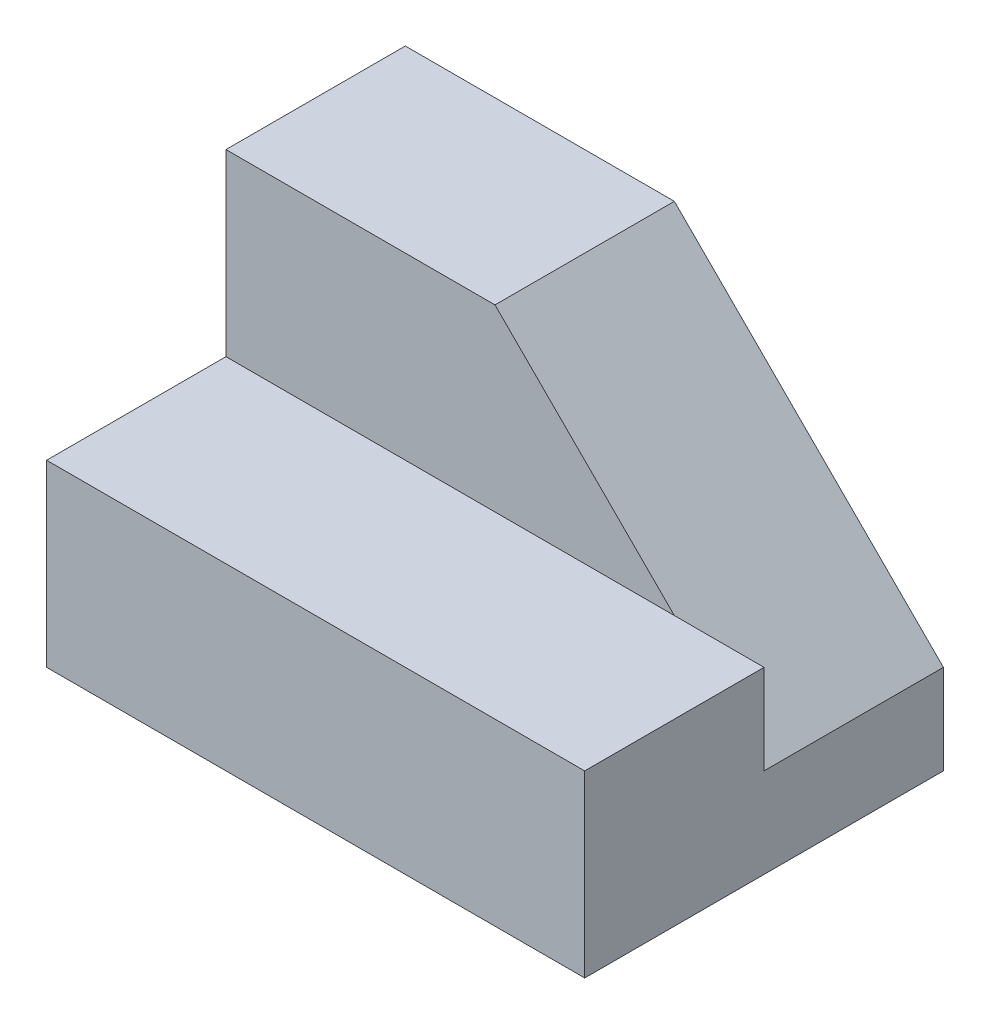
ISO-10303-21;
HEADER;
FILE_DESCRIPTION(('STEP AP214'),'2;1');
FILE_NAME('part.step','',(''),(''),'','','');
FILE_SCHEMA(('AUTOMOTIVE_DESIGN { 1 0 10303 214 1 1 1 1 }'));
ENDSEC;
DATA;
#1=APPLICATION_CONTEXT('core data for automotive mechanical design processes');
#2=APPLICATION_PROTOCOL_DEFINITION('international standard','automotive_design',2000,#1);
#3=PRODUCT_CONTEXT('',#1,'mechanical');
#4=PRODUCT('Part','Part','',(#3));
#5=PRODUCT_RELATED_PRODUCT_CATEGORY('part','',(#4));
#6=PRODUCT_DEFINITION_FORMATION('','',#4);
#7=PRODUCT_DEFINITION_CONTEXT('part definition',#1,'design');
#8=PRODUCT_DEFINITION('design','',#6,#7);
#9=PRODUCT_DEFINITION_SHAPE('','',#8);
#10=(LENGTH_UNIT() NAMED_UNIT(*) SI_UNIT(.MILLI.,.METRE.));
#11=(NAMED_UNIT(*) PLANE_ANGLE_UNIT() SI_UNIT($,.RADIAN.));
#12=(NAMED_UNIT(*) SI_UNIT($,.STERADIAN.) SOLID_ANGLE_UNIT());
#13=UNCERTAINTY_MEASURE_WITH_UNIT(LENGTH_MEASURE(1.E-05),#10,'distance_accuracy_value','');
#14=(GEOMETRIC_REPRESENTATION_CONTEXT(3) GLOBAL_UNCERTAINTY_ASSIGNED_CONTEXT((#13)) GLOBAL_UNIT_ASSIGNED_CONTEXT((#10,
#11,#12)) REPRESENTATION_CONTEXT('',''));
#15=CARTESIAN_POINT('',(0.,0.,0.));
#16=DIRECTION('',(0.,0.,1.));
#17=DIRECTION('',(1.,0.,0.));
#18=AXIS2_PLACEMENT_3D('',#15,#16,#17);
#19=CARTESIAN_POINT('',(-30.,40.,20.));
#20=DIRECTION('',(1.,0.,0.));
#21=DIRECTION('',(0.,0.,-1.));
#22=AXIS2_PLACEMENT_3D('',#19,#20,#21);
#23=PLANE('',#22);
#24=DIRECTION('',(0.,-1.,0.));
#25=VECTOR('',#24,1.);
#26=CARTESIAN_POINT('',(-30.,40.,20.));
#27=LINE('',#26,#25);
#28=CARTESIAN_POINT('',(-30.,20.,20.));
#29=VERTEX_POINT('',#28);
#30=CARTESIAN_POINT('',(-30.,0.,20.));
#31=VERTEX_POINT('',#30);
#32=EDGE_CURVE('E38',#29,#31,#27,.T.);
#33=ORIENTED_EDGE('',*,*,#32,.F.);
#34=DIRECTION('',(0.,0.,1.));
#35=VECTOR('',#34,1.);
#36=CARTESIAN_POINT('',(-30.,20.,0.));
#37=LINE('',#36,#35);
#38=CARTESIAN_POINT('',(-30.,20.,0.));
#39=VERTEX_POINT('',#38);
#40=EDGE_CURVE('E116',#39,#29,#37,.T.);
#41=ORIENTED_EDGE('',*,*,#40,.F.);
#42=DIRECTION('',(0.,-1.,0.));
#43=VECTOR('',#42,1.);
#44=CARTESIAN_POINT('',(-30.,20.,0.));
#45=LINE('',#44,#43);
#46=CARTESIAN_POINT('',(-30.,40.,0.));
#47=VERTEX_POINT('',#46);
#48=EDGE_CURVE('E124',#47,#39,#45,.T.);
#49=ORIENTED_EDGE('',*,*,#48,.F.);
#50=DIRECTION('',(0.,0.,1.));
#51=VECTOR('',#50,1.);
#52=CARTESIAN_POINT('',(-30.,40.,20.));
#53=LINE('',#52,#51);
#54=CARTESIAN_POINT('',(-30.,40.,-20.));
#55=VERTEX_POINT('',#54);
#56=EDGE_CURVE('E98',#55,#47,#53,.T.);
#57=ORIENTED_EDGE('',*,*,#56,.F.);
#58=DIRECTION('',(0.,-1.,0.));
#59=VECTOR('',#58,1.);
#60=CARTESIAN_POINT('',(-30.,40.,-20.));
#61=LINE('',#60,#59);
#62=CARTESIAN_POINT('',(-30.,0.,-20.));
#63=VERTEX_POINT('',#62);
#64=EDGE_CURVE('E82',#55,#63,#61,.T.);
#65=ORIENTED_EDGE('',*,*,#64,.T.);
#66=DIRECTION('',(0.,0.,1.));
#67=VECTOR('',#66,1.);
#68=CARTESIAN_POINT('',(-30.,0.,20.));
#69=LINE('',#68,#67);
#70=EDGE_CURVE('E97',#63,#31,#69,.T.);
#71=ORIENTED_EDGE('',*,*,#70,.T.);
#72=EDGE_LOOP('',(#33,#41,#49,#57,#65,#71));
#73=FACE_BOUND('',#72,.T.);
#74=ADVANCED_FACE('F31',(#73),#23,.F.);
#75=CARTESIAN_POINT('',(-30.,40.,20.));
#76=DIRECTION('',(0.,0.,-1.));
#77=DIRECTION('',(-1.,0.,0.));
#78=AXIS2_PLACEMENT_3D('',#75,#76,#77);
#79=PLANE('',#78);
#80=DIRECTION('',(0.,-1.,0.));
#81=VECTOR('',#80,1.);
#82=CARTESIAN_POINT('',(30.,40.,20.));
#83=LINE('',#82,#81);
#84=CARTESIAN_POINT('',(30.,20.,20.));
#85=VERTEX_POINT('',#84);
#86=CARTESIAN_POINT('',(30.,0.,20.));
#87=VERTEX_POINT('',#86);
#88=EDGE_CURVE('E81',#85,#87,#83,.T.);
#89=ORIENTED_EDGE('',*,*,#88,.F.);
#90=DIRECTION('',(1.,0.,0.));
#91=VECTOR('',#90,1.);
#92=CARTESIAN_POINT('',(-30.,20.,20.));
#93=LINE('',#92,#91);
#94=EDGE_CURVE('E110',#29,#85,#93,.T.);
#95=ORIENTED_EDGE('',*,*,#94,.F.);
#96=ORIENTED_EDGE('',*,*,#32,.T.);
#97=DIRECTION('',(1.,0.,0.));
#98=VECTOR('',#97,1.);
#99=CARTESIAN_POINT('',(-30.,0.,20.));
#100=LINE('',#99,#98);
#101=EDGE_CURVE('E92',#31,#87,#100,.T.);
#102=ORIENTED_EDGE('',*,*,#101,.T.);
#103=EDGE_LOOP('',(#89,#95,#96,#102));
#104=FACE_BOUND('',#103,.T.);
#105=ADVANCED_FACE('F107',(#104),#79,.F.);
#106=CARTESIAN_POINT('',(30.,40.,20.));
#107=DIRECTION('',(-1.,0.,0.));
#108=DIRECTION('',(0.,0.,1.));
#109=AXIS2_PLACEMENT_3D('',#106,#107,#108);
#110=PLANE('',#109);
#111=DIRECTION('',(0.,-1.,0.));
#112=VECTOR('',#111,1.);
#113=CARTESIAN_POINT('',(30.,40.,-20.));
#114=LINE('',#113,#112);
#115=CARTESIAN_POINT('',(30.,10.,-20.));
#116=VERTEX_POINT('',#115);
#117=CARTESIAN_POINT('',(30.,0.,-20.));
#118=VERTEX_POINT('',#117);
#119=EDGE_CURVE('E71',#116,#118,#114,.T.);
#120=ORIENTED_EDGE('',*,*,#119,.F.);
#121=DIRECTION('',(0.,0.,-1.));
#122=VECTOR('',#121,1.);
#123=CARTESIAN_POINT('',(30.,10.,0.));
#124=LINE('',#123,#122);
#125=CARTESIAN_POINT('',(30.,10.,0.));
#126=VERTEX_POINT('',#125);
#127=EDGE_CURVE('E133',#126,#116,#124,.T.);
#128=ORIENTED_EDGE('',*,*,#127,.F.);
#129=DIRECTION('',(0.,-1.,0.));
#130=VECTOR('',#129,1.);
#131=CARTESIAN_POINT('',(30.,10.,0.));
#132=LINE('',#131,#130);
#133=CARTESIAN_POINT('',(30.,20.,0.));
#134=VERTEX_POINT('',#133);
#135=EDGE_CURVE('E139',#134,#126,#132,.T.);
#136=ORIENTED_EDGE('',*,*,#135,.F.);
#137=DIRECTION('',(0.,0.,1.));
#138=VECTOR('',#137,1.);
#139=CARTESIAN_POINT('',(30.,20.,0.));
#140=LINE('',#139,#138);
#141=EDGE_CURVE('E114',#134,#85,#140,.T.);
#142=ORIENTED_EDGE('',*,*,#141,.T.);
#143=ORIENTED_EDGE('',*,*,#88,.T.);
#144=DIRECTION('',(0.,0.,-1.));
#145=VECTOR('',#144,1.);
#146=CARTESIAN_POINT('',(30.,0.,20.));
#147=LINE('',#146,#145);
#148=EDGE_CURVE('E85',#87,#118,#147,.T.);
#149=ORIENTED_EDGE('',*,*,#148,.T.);
#150=EDGE_LOOP('',(#120,#128,#136,#142,#143,#149));
#151=FACE_BOUND('',#150,.T.);
#152=ADVANCED_FACE('F86',(#151),#110,.F.);
#153=CARTESIAN_POINT('',(-30.,40.,-20.));
#154=DIRECTION('',(0.,0.,1.));
#155=DIRECTION('',(1.,0.,0.));
#156=AXIS2_PLACEMENT_3D('',#153,#154,#155);
#157=PLANE('',#156);
#158=DIRECTION('',(-1.,0.,0.));
#159=VECTOR('',#158,1.);
#160=CARTESIAN_POINT('',(-30.,40.,-20.));
#161=LINE('',#160,#159);
#162=CARTESIAN_POINT('',(0.,40.,-20.));
#163=VERTEX_POINT('',#162);
#164=EDGE_CURVE('E52',#163,#55,#161,.T.);
#165=ORIENTED_EDGE('',*,*,#164,.F.);
#166=DIRECTION('',(-0.707106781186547,0.707106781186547,0.));
#167=VECTOR('',#166,1.);
#168=CARTESIAN_POINT('',(0.,40.,-20.));
#169=LINE('',#168,#167);
#170=EDGE_CURVE('E78',#116,#163,#169,.T.);
#171=ORIENTED_EDGE('',*,*,#170,.F.);
#172=ORIENTED_EDGE('',*,*,#119,.T.);
#173=DIRECTION('',(-1.,0.,0.));
#174=VECTOR('',#173,1.);
#175=CARTESIAN_POINT('',(-30.,0.,-20.));
#176=LINE('',#175,#174);
#177=EDGE_CURVE('E75',#118,#63,#176,.T.);
#178=ORIENTED_EDGE('',*,*,#177,.T.);
#179=ORIENTED_EDGE('',*,*,#64,.F.);
#180=EDGE_LOOP('',(#165,#171,#172,#178,#179));
#181=FACE_BOUND('',#180,.T.);
#182=ADVANCED_FACE('F73',(#181),#157,.F.);
#183=CARTESIAN_POINT('',(-30.,40.,-20.));
#184=DIRECTION('',(0.,-1.,0.));
#185=DIRECTION('',(0.,0.,-1.));
#186=AXIS2_PLACEMENT_3D('',#183,#184,#185);
#187=PLANE('',#186);
#188=DIRECTION('',(-1.,0.,0.));
#189=VECTOR('',#188,1.);
#190=CARTESIAN_POINT('',(-30.,40.,0.));
#191=LINE('',#190,#189);
#192=CARTESIAN_POINT('',(0.,40.,0.));
#193=VERTEX_POINT('',#192);
#194=EDGE_CURVE('E121',#193,#47,#191,.T.);
#195=ORIENTED_EDGE('',*,*,#194,.F.);
#196=DIRECTION('',(0.,0.,-1.));
#197=VECTOR('',#196,1.);
#198=CARTESIAN_POINT('',(0.,40.,0.));
#199=LINE('',#198,#197);
#200=EDGE_CURVE('E45',#193,#163,#199,.T.);
#201=ORIENTED_EDGE('',*,*,#200,.T.);
#202=ORIENTED_EDGE('',*,*,#164,.T.);
#203=ORIENTED_EDGE('',*,*,#56,.T.);
#204=EDGE_LOOP('',(#195,#201,#202,#203));
#205=FACE_BOUND('',#204,.T.);
#206=ADVANCED_FACE('F162',(#205),#187,.F.);
#207=CARTESIAN_POINT('',(-30.,0.,-20.));
#208=DIRECTION('',(0.,-1.,0.));
#209=DIRECTION('',(0.,0.,-1.));
#210=AXIS2_PLACEMENT_3D('',#207,#208,#209);
#211=PLANE('',#210);
#212=ORIENTED_EDGE('',*,*,#70,.F.);
#213=ORIENTED_EDGE('',*,*,#177,.F.);
#214=ORIENTED_EDGE('',*,*,#148,.F.);
#215=ORIENTED_EDGE('',*,*,#101,.F.);
#216=EDGE_LOOP('',(#212,#213,#214,#215));
#217=FACE_BOUND('',#216,.T.);
#218=ADVANCED_FACE('F95',(#217),#211,.T.);
#219=CARTESIAN_POINT('',(-30.,20.,0.));
#220=DIRECTION('',(0.,-1.,0.));
#221=DIRECTION('',(0.,0.,-1.));
#222=AXIS2_PLACEMENT_3D('',#219,#220,#221);
#223=PLANE('',#222);
#224=ORIENTED_EDGE('',*,*,#94,.T.);
#225=ORIENTED_EDGE('',*,*,#141,.F.);
#226=DIRECTION('',(1.,0.,0.));
#227=VECTOR('',#226,1.);
#228=CARTESIAN_POINT('',(-30.,20.,0.));
#229=LINE('',#228,#227);
#230=CARTESIAN_POINT('',(20.,20.,0.));
#231=VERTEX_POINT('',#230);
#232=EDGE_CURVE('E130',#231,#134,#229,.T.);
#233=ORIENTED_EDGE('',*,*,#232,.F.);
#234=EDGE_CURVE('E127',#39,#231,#229,.T.);
#235=ORIENTED_EDGE('',*,*,#234,.F.);
#236=ORIENTED_EDGE('',*,*,#40,.T.);
#237=EDGE_LOOP('',(#224,#225,#233,#235,#236));
#238=FACE_BOUND('',#237,.T.);
#239=ADVANCED_FACE('F168',(#238),#223,.F.);
#240=CARTESIAN_POINT('',(-30.,40.,0.));
#241=DIRECTION('',(0.,0.,-1.));
#242=DIRECTION('',(-1.,0.,0.));
#243=AXIS2_PLACEMENT_3D('',#240,#241,#242);
#244=PLANE('',#243);
#245=ORIENTED_EDGE('',*,*,#234,.T.);
#246=DIRECTION('',(-0.707106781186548,0.707106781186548,0.));
#247=VECTOR('',#246,1.);
#248=CARTESIAN_POINT('',(-15.,55.,0.));
#249=LINE('',#248,#247);
#250=EDGE_CURVE('E11',#231,#193,#249,.T.);
#251=ORIENTED_EDGE('',*,*,#250,.T.);
#252=ORIENTED_EDGE('',*,*,#194,.T.);
#253=ORIENTED_EDGE('',*,*,#48,.T.);
#254=EDGE_LOOP('',(#245,#251,#252,#253));
#255=FACE_BOUND('',#254,.T.);
#256=ADVANCED_FACE('F159',(#255),#244,.F.);
#257=CARTESIAN_POINT('',(30.,40.,0.));
#258=DIRECTION('',(0.,0.,-1.));
#259=DIRECTION('',(-1.,0.,0.));
#260=AXIS2_PLACEMENT_3D('',#257,#258,#259);
#261=PLANE('',#260);
#262=ORIENTED_EDGE('',*,*,#232,.T.);
#263=ORIENTED_EDGE('',*,*,#135,.T.);
#264=DIRECTION('',(-0.707106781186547,0.707106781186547,0.));
#265=VECTOR('',#264,1.);
#266=CARTESIAN_POINT('',(0.,40.,0.));
#267=LINE('',#266,#265);
#268=EDGE_CURVE('E136',#126,#231,#267,.T.);
#269=ORIENTED_EDGE('',*,*,#268,.T.);
#270=EDGE_LOOP('',(#262,#263,#269));
#271=FACE_BOUND('',#270,.T.);
#272=ADVANCED_FACE('F148',(#271),#261,.T.);
#273=CARTESIAN_POINT('',(0.,40.,0.));
#274=DIRECTION('',(-0.707106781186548,-0.707106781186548,0.));
#275=DIRECTION('',(0.707106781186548,-0.707106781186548,0.));
#276=AXIS2_PLACEMENT_3D('',#273,#274,#275);
#277=PLANE('',#276);
#278=ORIENTED_EDGE('',*,*,#170,.T.);
#279=ORIENTED_EDGE('',*,*,#200,.F.);
#280=ORIENTED_EDGE('',*,*,#250,.F.);
#281=ORIENTED_EDGE('',*,*,#268,.F.);
#282=ORIENTED_EDGE('',*,*,#127,.T.);
#283=EDGE_LOOP('',(#278,#279,#280,#281,#282));
#284=FACE_BOUND('',#283,.T.);
#285=ADVANCED_FACE('F155',(#284),#277,.F.);
#286=CLOSED_SHELL('',(#74,#105,#152,#182,#206,#218,#239,#256,#272,#285));
#287=MANIFOLD_SOLID_BREP('B2',#286);
#288=ADVANCED_BREP_SHAPE_REPRESENTATION('',(#18,#287),#14);
#289=SHAPE_DEFINITION_REPRESENTATION(#9,#288);
ENDSEC;
END-ISO-10303-21;
